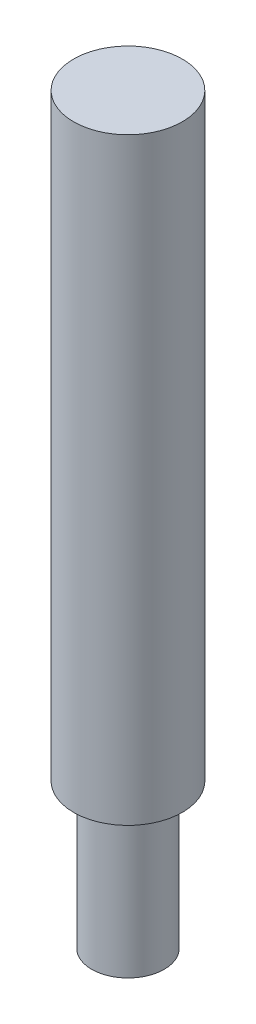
from build123d import *

# Parameters (mm, degrees)
SKETCH3_R           = 1.5
BOSS_EXTRUDE2_DEPTH = 16.5
SKETCH6_W           = 1
SKETCH6_H           = 1.5
CUT_EXTRUDE2_DEPTH  = 1
SKETCH7_R           = 1
BOSS_EXTRUDE3_DEPTH = 4


with BuildPart() as part:
    # Sketch3 → Boss-Extrude2 (new body)
    with BuildSketch(Plane(origin=(0, 0, 0), x_dir=(1, 0, 0), z_dir=(0, 1, 0))):
        with Locations(Location((1.5, 0, 0), (0, 0, 270))):
            Circle(SKETCH3_R)
    extrude(amount=BOSS_EXTRUDE2_DEPTH)

    # Sketch6 → Cut-Extrude2 (cut)
    with BuildSketch(Plane(origin=(0, 0, 0), x_dir=(0, 0, -1), z_dir=(1, 0, 0))):
        with Locations((0, 3.75)):
            Rectangle(SKETCH6_W, SKETCH6_H)
    extrude(amount=CUT_EXTRUDE2_DEPTH, mode=Mode.SUBTRACT)

    # Sketch7 → Boss-Extrude3 (add)
    with BuildSketch(Plane(origin=(0, 0, 0), x_dir=(-1, 0, 0), z_dir=(0, -1, 0))):
        with Locations(Location((-1.5, 0, 0), (0, 0, 270))):
            Circle(SKETCH7_R)
    extrude(amount=BOSS_EXTRUDE3_DEPTH)


solid = part.part
